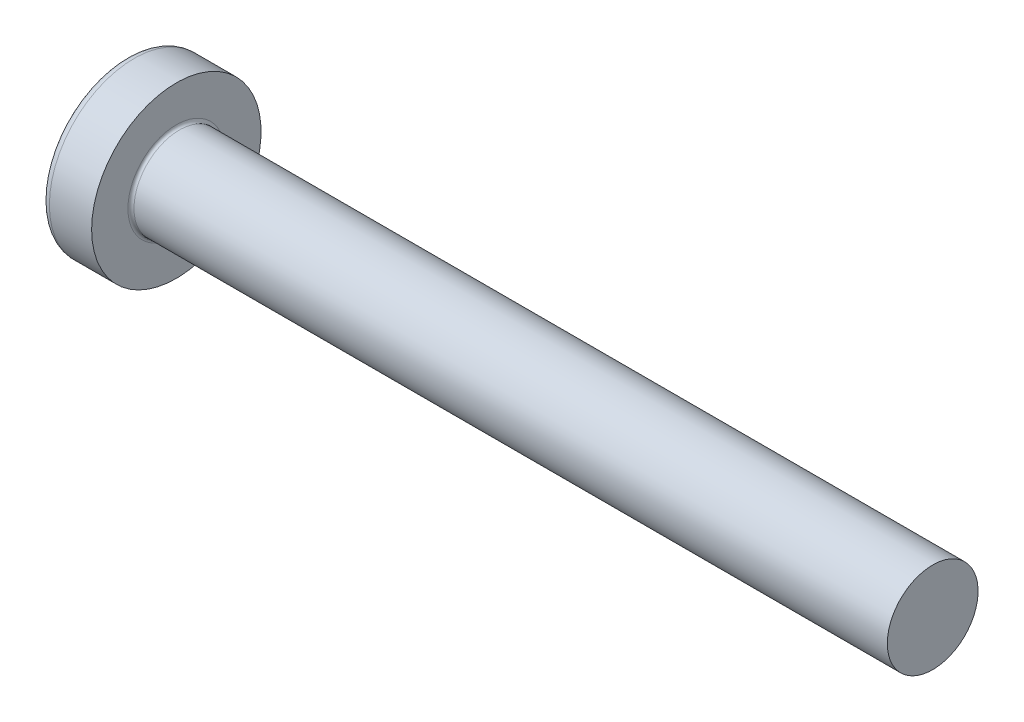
ISO-10303-21;
HEADER;
FILE_DESCRIPTION(('STEP AP214'),'2;1');
FILE_NAME('part.step','',(''),(''),'','','');
FILE_SCHEMA(('AUTOMOTIVE_DESIGN { 1 0 10303 214 1 1 1 1 }'));
ENDSEC;
DATA;
#1=APPLICATION_CONTEXT('core data for automotive mechanical design processes');
#2=APPLICATION_PROTOCOL_DEFINITION('international standard','automotive_design',2000,#1);
#3=PRODUCT_CONTEXT('',#1,'mechanical');
#4=PRODUCT('Part','Part','',(#3));
#5=PRODUCT_RELATED_PRODUCT_CATEGORY('part','',(#4));
#6=PRODUCT_DEFINITION_FORMATION('','',#4);
#7=PRODUCT_DEFINITION_CONTEXT('part definition',#1,'design');
#8=PRODUCT_DEFINITION('design','',#6,#7);
#9=PRODUCT_DEFINITION_SHAPE('','',#8);
#10=(LENGTH_UNIT() NAMED_UNIT(*) SI_UNIT(.MILLI.,.METRE.));
#11=(NAMED_UNIT(*) PLANE_ANGLE_UNIT() SI_UNIT($,.RADIAN.));
#12=(NAMED_UNIT(*) SI_UNIT($,.STERADIAN.) SOLID_ANGLE_UNIT());
#13=UNCERTAINTY_MEASURE_WITH_UNIT(LENGTH_MEASURE(1.E-05),#10,'distance_accuracy_value','');
#14=(GEOMETRIC_REPRESENTATION_CONTEXT(3) GLOBAL_UNCERTAINTY_ASSIGNED_CONTEXT((#13)) GLOBAL_UNIT_ASSIGNED_CONTEXT((#10,
#11,#12)) REPRESENTATION_CONTEXT('',''));
#15=CARTESIAN_POINT('',(0.,0.,0.));
#16=DIRECTION('',(0.,0.,1.));
#17=DIRECTION('',(1.,0.,0.));
#18=AXIS2_PLACEMENT_3D('',#15,#16,#17);
#19=CARTESIAN_POINT('',(5.,0.,0.));
#20=DIRECTION('',(-1.,0.,0.));
#21=DIRECTION('',(0.,1.,0.));
#22=AXIS2_PLACEMENT_3D('',#19,#20,#21);
#23=SPHERICAL_SURFACE('',#22,5.);
#24=CARTESIAN_POINT('',(0.775371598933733,0.,0.));
#25=DIRECTION('',(-1.,0.,0.));
#26=DIRECTION('',(0.,0.,1.));
#27=AXIS2_PLACEMENT_3D('',#24,#25,#26);
#28=CIRCLE('',#27,2.67441860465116);
#29=CARTESIAN_POINT('',(0.775371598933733,0.,2.67441860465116));
#30=VERTEX_POINT('',#29);
#31=EDGE_CURVE('E239',#30,#30,#28,.T.);
#32=ORIENTED_EDGE('',*,*,#31,.T.);
#33=EDGE_LOOP('',(#32));
#34=FACE_BOUND('',#33,.T.);
#35=CARTESIAN_POINT('',(0.0457951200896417,0.,0.));
#36=DIRECTION('',(1.,0.,0.));
#37=DIRECTION('',(0.,0.,-1.));
#38=AXIS2_PLACEMENT_3D('',#35,#36,#37);
#39=CIRCLE('',#38,0.675169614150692);
#40=CARTESIAN_POINT('',(0.0457951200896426,-0.369999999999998,-0.564760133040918));
#41=VERTEX_POINT('',#40);
#42=CARTESIAN_POINT('',(0.0457951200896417,-0.564760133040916,-0.37));
#43=VERTEX_POINT('',#42);
#44=EDGE_CURVE('E455',#41,#43,#39,.F.);
#45=ORIENTED_EDGE('',*,*,#44,.F.);
#46=CARTESIAN_POINT('',(5.,-0.37,0.));
#47=DIRECTION('',(0.,1.,0.));
#48=DIRECTION('',(0.,0.,1.));
#49=AXIS2_PLACEMENT_3D('',#46,#47,#48);
#50=CIRCLE('',#49,4.98629120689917);
#51=CARTESIAN_POINT('',(0.187869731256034,-0.369999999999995,-1.30633161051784));
#52=VERTEX_POINT('',#51);
#53=EDGE_CURVE('E286',#52,#41,#50,.T.);
#54=ORIENTED_EDGE('',*,*,#53,.F.);
#55=CARTESIAN_POINT('',(4.56358245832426,0.,0.875318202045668));
#56=DIRECTION('',(0.446197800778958,0.,-0.894934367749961));
#57=DIRECTION('',(-0.89493436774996,0.,-0.446197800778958));
#58=AXIS2_PLACEMENT_3D('',#55,#56,#57);
#59=CIRCLE('',#58,4.90340267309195);
#60=CARTESIAN_POINT('',(0.187869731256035,0.370000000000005,-1.30633161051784));
#61=VERTEX_POINT('',#60);
#62=EDGE_CURVE('E258',#52,#61,#59,.T.);
#63=ORIENTED_EDGE('',*,*,#62,.T.);
#64=CARTESIAN_POINT('',(5.,0.37,0.));
#65=DIRECTION('',(0.,-1.,0.));
#66=DIRECTION('',(0.,0.,-1.));
#67=AXIS2_PLACEMENT_3D('',#64,#65,#66);
#68=CIRCLE('',#67,4.98629120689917);
#69=CARTESIAN_POINT('',(0.0457951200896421,0.370000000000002,-0.564760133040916));
#70=VERTEX_POINT('',#69);
#71=EDGE_CURVE('E294',#70,#61,#68,.T.);
#72=ORIENTED_EDGE('',*,*,#71,.F.);
#73=CARTESIAN_POINT('',(0.0457951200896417,0.564760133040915,-0.37));
#74=VERTEX_POINT('',#73);
#75=EDGE_CURVE('E368',#74,#70,#39,.F.);
#76=ORIENTED_EDGE('',*,*,#75,.F.);
#77=CARTESIAN_POINT('',(5.,0.,-0.37));
#78=DIRECTION('',(0.,0.,1.));
#79=DIRECTION('',(1.,0.,0.));
#80=AXIS2_PLACEMENT_3D('',#77,#78,#79);
#81=CIRCLE('',#80,4.98629120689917);
#82=CARTESIAN_POINT('',(0.187869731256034,1.30633161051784,-0.37));
#83=VERTEX_POINT('',#82);
#84=EDGE_CURVE('E252',#83,#74,#81,.T.);
#85=ORIENTED_EDGE('',*,*,#84,.F.);
#86=CARTESIAN_POINT('',(4.56358245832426,-0.875318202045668,0.));
#87=DIRECTION('',(0.446197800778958,0.894934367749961,0.));
#88=DIRECTION('',(-0.89493436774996,0.446197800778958,0.));
#89=AXIS2_PLACEMENT_3D('',#86,#87,#88);
#90=CIRCLE('',#89,4.90340267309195);
#91=CARTESIAN_POINT('',(0.187869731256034,1.30633161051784,0.37));
#92=VERTEX_POINT('',#91);
#93=EDGE_CURVE('E255',#83,#92,#90,.T.);
#94=ORIENTED_EDGE('',*,*,#93,.T.);
#95=CARTESIAN_POINT('',(5.,0.,0.37));
#96=DIRECTION('',(0.,0.,-1.));
#97=DIRECTION('',(0.,1.,0.));
#98=AXIS2_PLACEMENT_3D('',#95,#96,#97);
#99=CIRCLE('',#98,4.98629120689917);
#100=CARTESIAN_POINT('',(0.0457951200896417,0.564760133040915,0.37));
#101=VERTEX_POINT('',#100);
#102=EDGE_CURVE('E248',#101,#92,#99,.T.);
#103=ORIENTED_EDGE('',*,*,#102,.F.);
#104=CARTESIAN_POINT('',(0.0457951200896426,0.369999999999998,0.564760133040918));
#105=VERTEX_POINT('',#104);
#106=EDGE_CURVE('E401',#105,#101,#39,.F.);
#107=ORIENTED_EDGE('',*,*,#106,.F.);
#108=CARTESIAN_POINT('',(0.187869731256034,0.369999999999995,1.30633161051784));
#109=VERTEX_POINT('',#108);
#110=EDGE_CURVE('E268',#109,#105,#68,.T.);
#111=ORIENTED_EDGE('',*,*,#110,.F.);
#112=CARTESIAN_POINT('',(4.56358245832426,0.,-0.875318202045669));
#113=DIRECTION('',(0.446197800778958,0.,0.894934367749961));
#114=DIRECTION('',(0.89493436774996,0.,-0.446197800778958));
#115=AXIS2_PLACEMENT_3D('',#112,#113,#114);
#116=CIRCLE('',#115,4.90340267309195);
#117=CARTESIAN_POINT('',(0.187869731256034,-0.370000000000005,1.30633161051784));
#118=VERTEX_POINT('',#117);
#119=EDGE_CURVE('E52',#109,#118,#116,.T.);
#120=ORIENTED_EDGE('',*,*,#119,.T.);
#121=CARTESIAN_POINT('',(0.0457951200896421,-0.370000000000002,0.564760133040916));
#122=VERTEX_POINT('',#121);
#123=EDGE_CURVE('E265',#122,#118,#50,.T.);
#124=ORIENTED_EDGE('',*,*,#123,.F.);
#125=CARTESIAN_POINT('',(0.0457951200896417,-0.564760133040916,0.37));
#126=VERTEX_POINT('',#125);
#127=EDGE_CURVE('E440',#126,#122,#39,.F.);
#128=ORIENTED_EDGE('',*,*,#127,.F.);
#129=CARTESIAN_POINT('',(0.187869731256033,-1.30633161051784,0.37));
#130=VERTEX_POINT('',#129);
#131=EDGE_CURVE('E249',#130,#126,#99,.T.);
#132=ORIENTED_EDGE('',*,*,#131,.F.);
#133=CARTESIAN_POINT('',(4.56358245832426,0.875318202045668,0.));
#134=DIRECTION('',(0.446197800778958,-0.894934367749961,0.));
#135=DIRECTION('',(0.89493436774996,0.446197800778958,0.));
#136=AXIS2_PLACEMENT_3D('',#133,#134,#135);
#137=CIRCLE('',#136,4.90340267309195);
#138=CARTESIAN_POINT('',(0.187869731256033,-1.30633161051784,-0.37));
#139=VERTEX_POINT('',#138);
#140=EDGE_CURVE('E245',#130,#139,#137,.T.);
#141=ORIENTED_EDGE('',*,*,#140,.T.);
#142=EDGE_CURVE('E67',#43,#139,#81,.T.);
#143=ORIENTED_EDGE('',*,*,#142,.F.);
#144=EDGE_LOOP('',(#45,#54,#63,#72,#76,#85,#94,#103,#107,#111,#120,#124,#128,#132,#141,#143));
#145=FACE_BOUND('',#144,.T.);
#146=ADVANCED_FACE('F39',(#34,#145),#23,.T.);
#147=CARTESIAN_POINT('',(1.75,0.527482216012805,-0.37));
#148=DIRECTION('',(0.,0.,1.));
#149=DIRECTION('',(1.,0.,0.));
#150=AXIS2_PLACEMENT_3D('',#147,#148,#149);
#151=PLANE('',#150);
#152=ORIENTED_EDGE('',*,*,#84,.T.);
#153=CARTESIAN_POINT('',(-0.987293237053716,0.649401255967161,-0.37));
#154=CARTESIAN_POINT('',(-0.781914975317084,0.632865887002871,-0.37));
#155=CARTESIAN_POINT('',(-0.576547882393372,0.616188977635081,-0.37));
#156=CARTESIAN_POINT('',(-0.165841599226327,0.582441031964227,-0.37));
#157=CARTESIAN_POINT('',(0.0394975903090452,0.56536998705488,-0.37));
#158=CARTESIAN_POINT('',(0.450133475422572,0.530723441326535,-0.37));
#159=CARTESIAN_POINT('',(0.655430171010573,0.513147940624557,-0.37));
#160=CARTESIAN_POINT('',(1.06596140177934,0.477314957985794,-0.37));
#161=CARTESIAN_POINT('',(1.2711959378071,0.459057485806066,-0.37));
#162=CARTESIAN_POINT('',(1.61065292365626,0.428051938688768,-0.37));
#163=CARTESIAN_POINT('',(1.74490059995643,0.415580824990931,-0.37));
#164=CARTESIAN_POINT('',(2.01334321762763,0.390092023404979,-0.37));
#165=CARTESIAN_POINT('',(2.14753815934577,0.377074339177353,-0.37));
#166=CARTESIAN_POINT('',(2.41586354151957,0.350315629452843,-0.37));
#167=CARTESIAN_POINT('',(2.5499939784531,0.33657456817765,-0.37));
#168=CARTESIAN_POINT('',(2.81814173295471,0.308004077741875,-0.37));
#169=CARTESIAN_POINT('',(2.95215904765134,0.293174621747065,-0.37));
#170=CARTESIAN_POINT('',(3.0860955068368,0.277618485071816,-0.37));
#171=B_SPLINE_CURVE_WITH_KNOTS('',3,(#153,#154,#155,#156,#157,#158,#159,#160,#161,#162,#163,
#164,#165,#166,#167,#168,#169,#170),.UNSPECIFIED.,.F.,.F.,(4,2,2,2,2,2,2,2,4),(0.,
0.618128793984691,1.23627109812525,1.85441325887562,2.4725465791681,2.87702276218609,
3.28149623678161,3.68598973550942,4.09049321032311),.UNSPECIFIED.);
#172=CARTESIAN_POINT('',(1.75,0.415013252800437,-0.37));
#173=VERTEX_POINT('',#172);
#174=EDGE_CURVE('E361',#74,#173,#171,.T.);
#175=ORIENTED_EDGE('',*,*,#174,.T.);
#176=DIRECTION('',(0.,1.,0.));
#177=VECTOR('',#176,1.);
#178=CARTESIAN_POINT('',(1.75,-0.527482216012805,-0.37));
#179=LINE('',#178,#177);
#180=CARTESIAN_POINT('',(1.75,0.527482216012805,-0.37));
#181=VERTEX_POINT('',#180);
#182=EDGE_CURVE('E311',#173,#181,#179,.T.);
#183=ORIENTED_EDGE('',*,*,#182,.T.);
#184=DIRECTION('',(0.89493436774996,-0.446197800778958,0.));
#185=VECTOR('',#184,1.);
#186=CARTESIAN_POINT('',(0.,1.4,-0.37));
#187=LINE('',#186,#185);
#188=EDGE_CURVE('E317',#83,#181,#187,.T.);
#189=ORIENTED_EDGE('',*,*,#188,.F.);
#190=EDGE_LOOP('',(#152,#175,#183,#189));
#191=FACE_BOUND('',#190,.T.);
#192=ADVANCED_FACE('F197',(#191),#151,.T.);
#193=CARTESIAN_POINT('',(1.75,-0.527482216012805,-0.37));
#194=VERTEX_POINT('',#193);
#195=CARTESIAN_POINT('',(1.75,-0.415013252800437,-0.37));
#196=VERTEX_POINT('',#195);
#197=EDGE_CURVE('E308',#194,#196,#179,.T.);
#198=ORIENTED_EDGE('',*,*,#197,.T.);
#199=CARTESIAN_POINT('',(-0.987293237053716,-0.649401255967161,-0.37));
#200=CARTESIAN_POINT('',(-0.781914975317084,-0.632865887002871,-0.37));
#201=CARTESIAN_POINT('',(-0.576547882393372,-0.616188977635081,-0.37));
#202=CARTESIAN_POINT('',(-0.165841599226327,-0.582441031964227,-0.37));
#203=CARTESIAN_POINT('',(0.0394975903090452,-0.56536998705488,-0.37));
#204=CARTESIAN_POINT('',(0.450133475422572,-0.530723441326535,-0.37));
#205=CARTESIAN_POINT('',(0.655430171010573,-0.513147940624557,-0.37));
#206=CARTESIAN_POINT('',(1.06596140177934,-0.477314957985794,-0.37));
#207=CARTESIAN_POINT('',(1.2711959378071,-0.459057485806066,-0.37));
#208=CARTESIAN_POINT('',(1.61065292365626,-0.428051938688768,-0.37));
#209=CARTESIAN_POINT('',(1.74490059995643,-0.415580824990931,-0.37));
#210=CARTESIAN_POINT('',(2.01334321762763,-0.390092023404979,-0.37));
#211=CARTESIAN_POINT('',(2.14753815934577,-0.377074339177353,-0.37));
#212=CARTESIAN_POINT('',(2.41586354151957,-0.350315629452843,-0.37));
#213=CARTESIAN_POINT('',(2.5499939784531,-0.33657456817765,-0.37));
#214=CARTESIAN_POINT('',(2.81814173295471,-0.308004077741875,-0.37));
#215=CARTESIAN_POINT('',(2.95215904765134,-0.293174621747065,-0.37));
#216=CARTESIAN_POINT('',(3.0860955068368,-0.277618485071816,-0.37));
#217=B_SPLINE_CURVE_WITH_KNOTS('',3,(#199,#200,#201,#202,#203,#204,#205,#206,#207,#208,#209,
#210,#211,#212,#213,#214,#215,#216),.UNSPECIFIED.,.F.,.F.,(4,2,2,2,2,2,2,2,4),(0.,
0.618128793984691,1.23627109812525,1.85441325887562,2.4725465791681,2.87702276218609,
3.28149623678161,3.68598973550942,4.09049321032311),.UNSPECIFIED.);
#218=EDGE_CURVE('E354',#196,#43,#217,.F.);
#219=ORIENTED_EDGE('',*,*,#218,.T.);
#220=ORIENTED_EDGE('',*,*,#142,.T.);
#221=DIRECTION('',(0.89493436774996,0.446197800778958,0.));
#222=VECTOR('',#221,1.);
#223=CARTESIAN_POINT('',(0.,-1.4,-0.37));
#224=LINE('',#223,#222);
#225=EDGE_CURVE('E314',#139,#194,#224,.T.);
#226=ORIENTED_EDGE('',*,*,#225,.T.);
#227=EDGE_LOOP('',(#198,#219,#220,#226));
#228=FACE_BOUND('',#227,.T.);
#229=ADVANCED_FACE('F203',(#228),#151,.T.);
#230=CARTESIAN_POINT('',(1.75,-0.527482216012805,0.37));
#231=DIRECTION('',(0.,0.,-1.));
#232=DIRECTION('',(0.,1.,0.));
#233=AXIS2_PLACEMENT_3D('',#230,#231,#232);
#234=PLANE('',#233);
#235=DIRECTION('',(0.,-1.,0.));
#236=VECTOR('',#235,1.);
#237=CARTESIAN_POINT('',(1.75,0.527482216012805,0.37));
#238=LINE('',#237,#236);
#239=CARTESIAN_POINT('',(1.75,0.527482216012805,0.37));
#240=VERTEX_POINT('',#239);
#241=CARTESIAN_POINT('',(1.75,0.415013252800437,0.37));
#242=VERTEX_POINT('',#241);
#243=EDGE_CURVE('E300',#240,#242,#238,.T.);
#244=ORIENTED_EDGE('',*,*,#243,.T.);
#245=CARTESIAN_POINT('',(-0.987293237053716,0.649401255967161,0.37));
#246=CARTESIAN_POINT('',(-0.781914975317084,0.632865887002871,0.37));
#247=CARTESIAN_POINT('',(-0.576547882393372,0.616188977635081,0.37));
#248=CARTESIAN_POINT('',(-0.165841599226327,0.582441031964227,0.37));
#249=CARTESIAN_POINT('',(0.0394975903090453,0.56536998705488,0.37));
#250=CARTESIAN_POINT('',(0.450133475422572,0.530723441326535,0.37));
#251=CARTESIAN_POINT('',(0.655430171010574,0.513147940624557,0.37));
#252=CARTESIAN_POINT('',(1.06596140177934,0.477314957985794,0.37));
#253=CARTESIAN_POINT('',(1.2711959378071,0.459057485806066,0.37));
#254=CARTESIAN_POINT('',(1.61065292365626,0.428051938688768,0.37));
#255=CARTESIAN_POINT('',(1.74490059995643,0.415580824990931,0.37));
#256=CARTESIAN_POINT('',(2.01334321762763,0.39009202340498,0.37));
#257=CARTESIAN_POINT('',(2.14753815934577,0.377074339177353,0.37));
#258=CARTESIAN_POINT('',(2.41586354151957,0.350315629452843,0.37));
#259=CARTESIAN_POINT('',(2.5499939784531,0.33657456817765,0.37));
#260=CARTESIAN_POINT('',(2.81814173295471,0.308004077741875,0.37));
#261=CARTESIAN_POINT('',(2.95215904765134,0.293174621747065,0.37));
#262=CARTESIAN_POINT('',(3.0860955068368,0.277618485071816,0.37));
#263=B_SPLINE_CURVE_WITH_KNOTS('',3,(#245,#246,#247,#248,#249,#250,#251,#252,#253,#254,#255,
#256,#257,#258,#259,#260,#261,#262),.UNSPECIFIED.,.F.,.F.,(4,2,2,2,2,2,2,2,4),(0.,
0.618128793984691,1.23627109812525,1.85441325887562,2.4725465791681,2.87702276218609,
3.28149623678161,3.68598973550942,4.09049321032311),.UNSPECIFIED.);
#264=EDGE_CURVE('E402',#242,#101,#263,.F.);
#265=ORIENTED_EDGE('',*,*,#264,.T.);
#266=ORIENTED_EDGE('',*,*,#102,.T.);
#267=DIRECTION('',(0.89493436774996,-0.446197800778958,0.));
#268=VECTOR('',#267,1.);
#269=CARTESIAN_POINT('',(0.,1.4,0.37));
#270=LINE('',#269,#268);
#271=EDGE_CURVE('E316',#92,#240,#270,.T.);
#272=ORIENTED_EDGE('',*,*,#271,.T.);
#273=EDGE_LOOP('',(#244,#265,#266,#272));
#274=FACE_BOUND('',#273,.T.);
#275=ADVANCED_FACE('F349',(#274),#234,.T.);
#276=ORIENTED_EDGE('',*,*,#131,.T.);
#277=CARTESIAN_POINT('',(-0.987293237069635,-0.649401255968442,0.37));
#278=CARTESIAN_POINT('',(-0.781914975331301,-0.632865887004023,0.37));
#279=CARTESIAN_POINT('',(-0.576547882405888,-0.616188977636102,0.37));
#280=CARTESIAN_POINT('',(-0.16584159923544,-0.582441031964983,0.37));
#281=CARTESIAN_POINT('',(0.0394975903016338,-0.5653699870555,0.37));
#282=CARTESIAN_POINT('',(0.450133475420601,-0.530723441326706,0.37));
#283=CARTESIAN_POINT('',(0.655430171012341,-0.513147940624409,0.37));
#284=CARTESIAN_POINT('',(1.06596140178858,-0.477314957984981,0.37));
#285=CARTESIAN_POINT('',(1.27119593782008,-0.459057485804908,0.37));
#286=CARTESIAN_POINT('',(1.61065292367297,-0.428051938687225,0.37));
#287=CARTESIAN_POINT('',(1.74490059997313,-0.415580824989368,0.37));
#288=CARTESIAN_POINT('',(2.01334321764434,-0.390092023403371,0.37));
#289=CARTESIAN_POINT('',(2.14753815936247,-0.377074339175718,0.37));
#290=CARTESIAN_POINT('',(2.41586354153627,-0.350315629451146,0.37));
#291=CARTESIAN_POINT('',(2.54999397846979,-0.336574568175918,0.37));
#292=CARTESIAN_POINT('',(2.8181417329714,-0.308004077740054,0.37));
#293=CARTESIAN_POINT('',(2.95215904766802,-0.29317462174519,0.37));
#294=CARTESIAN_POINT('',(3.08609550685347,-0.277618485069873,0.37));
#295=B_SPLINE_CURVE_WITH_KNOTS('',3,(#277,#278,#279,#280,#281,#282,#283,#284,#285,#286,#287,
#288,#289,#290,#291,#292,#293,#294),.UNSPECIFIED.,.F.,.F.,(4,2,2,2,2,2,2,2,4),(0.,
0.61812879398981,1.23627109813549,1.85441325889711,2.47254657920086,2.87702276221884,
3.28149623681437,3.68598973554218,4.09049321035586),.UNSPECIFIED.);
#296=CARTESIAN_POINT('',(1.75,-0.415013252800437,0.37));
#297=VERTEX_POINT('',#296);
#298=EDGE_CURVE('E392',#126,#297,#295,.T.);
#299=ORIENTED_EDGE('',*,*,#298,.T.);
#300=CARTESIAN_POINT('',(1.75,-0.527482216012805,0.37));
#301=VERTEX_POINT('',#300);
#302=EDGE_CURVE('E303',#297,#301,#238,.T.);
#303=ORIENTED_EDGE('',*,*,#302,.T.);
#304=DIRECTION('',(0.89493436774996,0.446197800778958,0.));
#305=VECTOR('',#304,1.);
#306=CARTESIAN_POINT('',(0.,-1.4,0.37));
#307=LINE('',#306,#305);
#308=EDGE_CURVE('E298',#130,#301,#307,.T.);
#309=ORIENTED_EDGE('',*,*,#308,.F.);
#310=EDGE_LOOP('',(#276,#299,#303,#309));
#311=FACE_BOUND('',#310,.T.);
#312=ADVANCED_FACE('F345',(#311),#234,.T.);
#313=CARTESIAN_POINT('',(1.75,0.527482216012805,0.37));
#314=DIRECTION('',(0.446197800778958,0.894934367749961,0.));
#315=DIRECTION('',(-0.89493436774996,0.446197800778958,0.));
#316=AXIS2_PLACEMENT_3D('',#313,#314,#315);
#317=PLANE('',#316);
#318=CARTESIAN_POINT('',(2.66965234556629,0.0689604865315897,0.));
#319=DIRECTION('',(0.446197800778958,0.894934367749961,0.));
#320=DIRECTION('',(-0.89493436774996,0.446197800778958,0.));
#321=AXIS2_PLACEMENT_3D('',#318,#319,#320);
#322=ELLIPSE('',#321,1.10195891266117,0.486831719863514);
#323=CARTESIAN_POINT('',(1.75,0.527482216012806,0.175779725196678));
#324=VERTEX_POINT('',#323);
#325=CARTESIAN_POINT('',(1.75,0.527482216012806,-0.175779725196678));
#326=VERTEX_POINT('',#325);
#327=EDGE_CURVE('E432',#324,#326,#322,.F.);
#328=ORIENTED_EDGE('',*,*,#327,.F.);
#329=DIRECTION('',(0.,0.,-1.));
#330=VECTOR('',#329,1.);
#331=CARTESIAN_POINT('',(1.75,0.527482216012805,0.37));
#332=LINE('',#331,#330);
#333=EDGE_CURVE('E304',#240,#324,#332,.T.);
#334=ORIENTED_EDGE('',*,*,#333,.F.);
#335=ORIENTED_EDGE('',*,*,#271,.F.);
#336=ORIENTED_EDGE('',*,*,#93,.F.);
#337=ORIENTED_EDGE('',*,*,#188,.T.);
#338=EDGE_CURVE('E307',#326,#181,#332,.T.);
#339=ORIENTED_EDGE('',*,*,#338,.F.);
#340=EDGE_LOOP('',(#328,#334,#335,#336,#337,#339));
#341=FACE_BOUND('',#340,.T.);
#342=ADVANCED_FACE('F342',(#341),#317,.F.);
#343=CARTESIAN_POINT('',(0.,-1.4,-0.37));
#344=DIRECTION('',(0.446197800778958,-0.894934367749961,0.));
#345=DIRECTION('',(0.89493436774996,0.446197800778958,0.));
#346=AXIS2_PLACEMENT_3D('',#343,#344,#345);
#347=PLANE('',#346);
#348=CARTESIAN_POINT('',(2.66965234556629,-0.0689604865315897,0.));
#349=DIRECTION('',(0.446197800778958,-0.894934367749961,0.));
#350=DIRECTION('',(-0.89493436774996,-0.446197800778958,0.));
#351=AXIS2_PLACEMENT_3D('',#348,#349,#350);
#352=ELLIPSE('',#351,1.10195891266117,0.486831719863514);
#353=CARTESIAN_POINT('',(1.75,-0.527482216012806,-0.175779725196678));
#354=VERTEX_POINT('',#353);
#355=CARTESIAN_POINT('',(1.75,-0.527482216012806,0.175779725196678));
#356=VERTEX_POINT('',#355);
#357=EDGE_CURVE('E428',#354,#356,#352,.F.);
#358=ORIENTED_EDGE('',*,*,#357,.F.);
#359=DIRECTION('',(0.,0.,1.));
#360=VECTOR('',#359,1.);
#361=CARTESIAN_POINT('',(1.75,-0.527482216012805,-0.37));
#362=LINE('',#361,#360);
#363=EDGE_CURVE('E295',#194,#354,#362,.T.);
#364=ORIENTED_EDGE('',*,*,#363,.F.);
#365=ORIENTED_EDGE('',*,*,#225,.F.);
#366=ORIENTED_EDGE('',*,*,#140,.F.);
#367=ORIENTED_EDGE('',*,*,#308,.T.);
#368=EDGE_CURVE('E299',#356,#301,#362,.T.);
#369=ORIENTED_EDGE('',*,*,#368,.F.);
#370=EDGE_LOOP('',(#358,#364,#365,#366,#367,#369));
#371=FACE_BOUND('',#370,.T.);
#372=ADVANCED_FACE('F344',(#371),#347,.F.);
#373=CARTESIAN_POINT('',(1.75,0.527482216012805,-0.37));
#374=DIRECTION('',(-1.,0.,0.));
#375=DIRECTION('',(0.,0.,1.));
#376=AXIS2_PLACEMENT_3D('',#373,#374,#375);
#377=PLANE('',#376);
#378=DIRECTION('',(0.,1.,0.));
#379=VECTOR('',#378,1.);
#380=CARTESIAN_POINT('',(1.75,-0.370000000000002,0.527482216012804));
#381=LINE('',#380,#379);
#382=CARTESIAN_POINT('',(1.75,-0.370000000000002,0.527482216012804));
#383=VERTEX_POINT('',#382);
#384=CARTESIAN_POINT('',(1.75,-0.175779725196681,0.527482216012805));
#385=VERTEX_POINT('',#384);
#386=EDGE_CURVE('E496',#383,#385,#381,.T.);
#387=ORIENTED_EDGE('',*,*,#386,.T.);
#388=CARTESIAN_POINT('',(1.75,0.,0.));
#389=DIRECTION('',(-1.,0.,0.));
#390=DIRECTION('',(0.,0.,1.));
#391=AXIS2_PLACEMENT_3D('',#388,#389,#390);
#392=CIRCLE('',#391,0.556);
#393=CARTESIAN_POINT('',(1.75,-0.370000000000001,0.415013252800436));
#394=VERTEX_POINT('',#393);
#395=EDGE_CURVE('E453',#394,#385,#392,.T.);
#396=ORIENTED_EDGE('',*,*,#395,.F.);
#397=DIRECTION('',(0.,0.,-1.));
#398=VECTOR('',#397,1.);
#399=CARTESIAN_POINT('',(1.75,-0.370000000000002,0.527482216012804));
#400=LINE('',#399,#398);
#401=EDGE_CURVE('E491',#383,#394,#400,.T.);
#402=ORIENTED_EDGE('',*,*,#401,.F.);
#403=EDGE_LOOP('',(#387,#396,#402));
#404=FACE_BOUND('',#403,.T.);
#405=ADVANCED_FACE('F417',(#404),#377,.T.);
#406=ORIENTED_EDGE('',*,*,#302,.F.);
#407=EDGE_CURVE('E448',#356,#297,#392,.T.);
#408=ORIENTED_EDGE('',*,*,#407,.F.);
#409=ORIENTED_EDGE('',*,*,#368,.T.);
#410=EDGE_LOOP('',(#406,#408,#409));
#411=FACE_BOUND('',#410,.T.);
#412=ADVANCED_FACE('F419',(#411),#377,.T.);
#413=ORIENTED_EDGE('',*,*,#363,.T.);
#414=EDGE_CURVE('E437',#196,#354,#392,.T.);
#415=ORIENTED_EDGE('',*,*,#414,.F.);
#416=ORIENTED_EDGE('',*,*,#197,.F.);
#417=EDGE_LOOP('',(#413,#415,#416));
#418=FACE_BOUND('',#417,.T.);
#419=ADVANCED_FACE('F435',(#418),#377,.T.);
#420=CARTESIAN_POINT('',(1.75,-0.369999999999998,-0.415013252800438));
#421=VERTEX_POINT('',#420);
#422=CARTESIAN_POINT('',(1.75,-0.369999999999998,-0.527482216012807));
#423=VERTEX_POINT('',#422);
#424=EDGE_CURVE('E485',#421,#423,#400,.T.);
#425=ORIENTED_EDGE('',*,*,#424,.F.);
#426=CARTESIAN_POINT('',(1.75,-0.175779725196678,-0.527482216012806));
#427=VERTEX_POINT('',#426);
#428=EDGE_CURVE('E59',#427,#421,#392,.T.);
#429=ORIENTED_EDGE('',*,*,#428,.F.);
#430=DIRECTION('',(0.,-1.,0.));
#431=VECTOR('',#430,1.);
#432=CARTESIAN_POINT('',(1.75,0.370000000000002,-0.527482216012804));
#433=LINE('',#432,#431);
#434=EDGE_CURVE('E483',#427,#423,#433,.T.);
#435=ORIENTED_EDGE('',*,*,#434,.T.);
#436=EDGE_LOOP('',(#425,#429,#435));
#437=FACE_BOUND('',#436,.T.);
#438=ADVANCED_FACE('F482',(#437),#377,.T.);
#439=CARTESIAN_POINT('',(1.75,0.370000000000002,-0.527482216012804));
#440=VERTEX_POINT('',#439);
#441=CARTESIAN_POINT('',(1.75,0.175779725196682,-0.527482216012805));
#442=VERTEX_POINT('',#441);
#443=EDGE_CURVE('E490',#440,#442,#433,.T.);
#444=ORIENTED_EDGE('',*,*,#443,.T.);
#445=CARTESIAN_POINT('',(1.75,0.370000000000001,-0.415013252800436));
#446=VERTEX_POINT('',#445);
#447=EDGE_CURVE('E479',#446,#442,#392,.T.);
#448=ORIENTED_EDGE('',*,*,#447,.F.);
#449=DIRECTION('',(0.,0.,1.));
#450=VECTOR('',#449,1.);
#451=CARTESIAN_POINT('',(1.75,0.370000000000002,-0.527482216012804));
#452=LINE('',#451,#450);
#453=EDGE_CURVE('E500',#440,#446,#452,.T.);
#454=ORIENTED_EDGE('',*,*,#453,.F.);
#455=EDGE_LOOP('',(#444,#448,#454));
#456=FACE_BOUND('',#455,.T.);
#457=ADVANCED_FACE('F507',(#456),#377,.T.);
#458=ORIENTED_EDGE('',*,*,#182,.F.);
#459=EDGE_CURVE('E509',#326,#173,#392,.T.);
#460=ORIENTED_EDGE('',*,*,#459,.F.);
#461=ORIENTED_EDGE('',*,*,#338,.T.);
#462=EDGE_LOOP('',(#458,#460,#461));
#463=FACE_BOUND('',#462,.T.);
#464=ADVANCED_FACE('F535',(#463),#377,.T.);
#465=ORIENTED_EDGE('',*,*,#333,.T.);
#466=EDGE_CURVE('E514',#242,#324,#392,.T.);
#467=ORIENTED_EDGE('',*,*,#466,.F.);
#468=ORIENTED_EDGE('',*,*,#243,.F.);
#469=EDGE_LOOP('',(#465,#467,#468));
#470=FACE_BOUND('',#469,.T.);
#471=ADVANCED_FACE('F523',(#470),#377,.T.);
#472=CARTESIAN_POINT('',(1.75,0.369999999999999,0.415013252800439));
#473=VERTEX_POINT('',#472);
#474=CARTESIAN_POINT('',(1.75,0.369999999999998,0.527482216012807));
#475=VERTEX_POINT('',#474);
#476=EDGE_CURVE('E283',#473,#475,#452,.T.);
#477=ORIENTED_EDGE('',*,*,#476,.F.);
#478=CARTESIAN_POINT('',(1.75,0.175779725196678,0.527482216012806));
#479=VERTEX_POINT('',#478);
#480=EDGE_CURVE('E454',#479,#473,#392,.T.);
#481=ORIENTED_EDGE('',*,*,#480,.F.);
#482=EDGE_CURVE('E499',#479,#475,#381,.T.);
#483=ORIENTED_EDGE('',*,*,#482,.T.);
#484=EDGE_LOOP('',(#477,#481,#483));
#485=FACE_BOUND('',#484,.T.);
#486=ADVANCED_FACE('F411',(#485),#377,.T.);
#487=CARTESIAN_POINT('',(1.75,0.369999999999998,0.527482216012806));
#488=DIRECTION('',(0.,-1.,0.));
#489=DIRECTION('',(1.,0.,0.));
#490=AXIS2_PLACEMENT_3D('',#487,#488,#489);
#491=PLANE('',#490);
#492=ORIENTED_EDGE('',*,*,#110,.T.);
#493=CARTESIAN_POINT('',(-0.987293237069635,0.369999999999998,0.649401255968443));
#494=CARTESIAN_POINT('',(-0.781914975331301,0.369999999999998,0.632865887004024));
#495=CARTESIAN_POINT('',(-0.576547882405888,0.369999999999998,0.616188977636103));
#496=CARTESIAN_POINT('',(-0.16584159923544,0.369999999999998,0.582441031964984));
#497=CARTESIAN_POINT('',(0.0394975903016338,0.369999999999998,0.565369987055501));
#498=CARTESIAN_POINT('',(0.450133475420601,0.369999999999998,0.530723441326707));
#499=CARTESIAN_POINT('',(0.655430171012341,0.369999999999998,0.51314794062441));
#500=CARTESIAN_POINT('',(1.06596140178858,0.369999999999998,0.477314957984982));
#501=CARTESIAN_POINT('',(1.27119593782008,0.369999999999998,0.459057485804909));
#502=CARTESIAN_POINT('',(1.61065292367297,0.369999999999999,0.428051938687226));
#503=CARTESIAN_POINT('',(1.74490059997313,0.369999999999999,0.415580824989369));
#504=CARTESIAN_POINT('',(2.01334321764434,0.369999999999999,0.390092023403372));
#505=CARTESIAN_POINT('',(2.14753815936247,0.369999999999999,0.37707433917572));
#506=CARTESIAN_POINT('',(2.41586354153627,0.369999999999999,0.350315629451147));
#507=CARTESIAN_POINT('',(2.54999397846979,0.369999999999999,0.336574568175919));
#508=CARTESIAN_POINT('',(2.8181417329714,0.369999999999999,0.308004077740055));
#509=CARTESIAN_POINT('',(2.95215904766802,0.369999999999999,0.293174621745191));
#510=CARTESIAN_POINT('',(3.08609550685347,0.369999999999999,0.277618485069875));
#511=B_SPLINE_CURVE_WITH_KNOTS('',3,(#493,#494,#495,#496,#497,#498,#499,#500,#501,#502,#503,
#504,#505,#506,#507,#508,#509,#510),.UNSPECIFIED.,.F.,.F.,(4,2,2,2,2,2,2,2,4),(0.,
0.61812879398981,1.23627109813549,1.85441325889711,2.47254657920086,2.87702276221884,
3.28149623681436,3.68598973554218,4.09049321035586),.UNSPECIFIED.);
#512=EDGE_CURVE('E397',#105,#473,#511,.T.);
#513=ORIENTED_EDGE('',*,*,#512,.T.);
#514=ORIENTED_EDGE('',*,*,#476,.T.);
#515=DIRECTION('',(0.89493436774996,0.,-0.446197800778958));
#516=VECTOR('',#515,1.);
#517=CARTESIAN_POINT('',(0.,0.369999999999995,1.4));
#518=LINE('',#517,#516);
#519=EDGE_CURVE('E276',#109,#475,#518,.T.);
#520=ORIENTED_EDGE('',*,*,#519,.F.);
#521=EDGE_LOOP('',(#492,#513,#514,#520));
#522=FACE_BOUND('',#521,.T.);
#523=ADVANCED_FACE('F280',(#522),#491,.T.);
#524=CARTESIAN_POINT('',(1.75,-0.369999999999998,-0.527482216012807));
#525=DIRECTION('',(0.,1.,0.));
#526=DIRECTION('',(0.,0.,1.));
#527=AXIS2_PLACEMENT_3D('',#524,#525,#526);
#528=PLANE('',#527);
#529=ORIENTED_EDGE('',*,*,#401,.T.);
#530=CARTESIAN_POINT('',(-0.987293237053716,-0.370000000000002,0.64940125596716));
#531=CARTESIAN_POINT('',(-0.781914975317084,-0.370000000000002,0.63286588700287));
#532=CARTESIAN_POINT('',(-0.576547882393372,-0.370000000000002,0.61618897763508));
#533=CARTESIAN_POINT('',(-0.165841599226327,-0.370000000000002,0.582441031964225));
#534=CARTESIAN_POINT('',(0.0394975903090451,-0.370000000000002,0.565369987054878));
#535=CARTESIAN_POINT('',(0.450133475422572,-0.370000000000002,0.530723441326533));
#536=CARTESIAN_POINT('',(0.655430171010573,-0.370000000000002,0.513147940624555));
#537=CARTESIAN_POINT('',(1.06596140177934,-0.370000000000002,0.477314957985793));
#538=CARTESIAN_POINT('',(1.2711959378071,-0.370000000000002,0.459057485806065));
#539=CARTESIAN_POINT('',(1.61065292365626,-0.370000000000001,0.428051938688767));
#540=CARTESIAN_POINT('',(1.74490059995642,-0.370000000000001,0.41558082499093));
#541=CARTESIAN_POINT('',(2.01334321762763,-0.370000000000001,0.390092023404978));
#542=CARTESIAN_POINT('',(2.14753815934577,-0.370000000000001,0.377074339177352));
#543=CARTESIAN_POINT('',(2.41586354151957,-0.370000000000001,0.350315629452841));
#544=CARTESIAN_POINT('',(2.5499939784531,-0.370000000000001,0.336574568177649));
#545=CARTESIAN_POINT('',(2.81814173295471,-0.370000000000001,0.308004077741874));
#546=CARTESIAN_POINT('',(2.95215904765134,-0.370000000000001,0.293174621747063));
#547=CARTESIAN_POINT('',(3.0860955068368,-0.370000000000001,0.277618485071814));
#548=B_SPLINE_CURVE_WITH_KNOTS('',3,(#530,#531,#532,#533,#534,#535,#536,#537,#538,#539,#540,
#541,#542,#543,#544,#545,#546,#547),.UNSPECIFIED.,.F.,.F.,(4,2,2,2,2,2,2,2,4),(0.,
0.618128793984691,1.23627109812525,1.85441325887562,2.4725465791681,2.87702276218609,
3.28149623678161,3.68598973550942,4.09049321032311),.UNSPECIFIED.);
#549=EDGE_CURVE('E387',#394,#122,#548,.F.);
#550=ORIENTED_EDGE('',*,*,#549,.T.);
#551=ORIENTED_EDGE('',*,*,#123,.T.);
#552=DIRECTION('',(0.89493436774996,0.,-0.446197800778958));
#553=VECTOR('',#552,1.);
#554=CARTESIAN_POINT('',(0.,-0.370000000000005,1.4));
#555=LINE('',#554,#553);
#556=EDGE_CURVE('E278',#118,#383,#555,.T.);
#557=ORIENTED_EDGE('',*,*,#556,.T.);
#558=EDGE_LOOP('',(#529,#550,#551,#557));
#559=FACE_BOUND('',#558,.T.);
#560=ADVANCED_FACE('F410',(#559),#528,.T.);
#561=CARTESIAN_POINT('',(1.75,-0.370000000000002,0.527482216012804));
#562=DIRECTION('',(0.446197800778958,0.,0.894934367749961));
#563=DIRECTION('',(-0.89493436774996,0.,0.446197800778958));
#564=AXIS2_PLACEMENT_3D('',#561,#562,#563);
#565=PLANE('',#564);
#566=CARTESIAN_POINT('',(2.66965234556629,0.,0.0689604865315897));
#567=DIRECTION('',(0.446197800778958,0.,0.894934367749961));
#568=DIRECTION('',(-0.89493436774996,0.,0.446197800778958));
#569=AXIS2_PLACEMENT_3D('',#566,#567,#568);
#570=ELLIPSE('',#569,1.10195891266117,0.486831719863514);
#571=EDGE_CURVE('E463',#385,#479,#570,.F.);
#572=ORIENTED_EDGE('',*,*,#571,.F.);
#573=ORIENTED_EDGE('',*,*,#386,.F.);
#574=ORIENTED_EDGE('',*,*,#556,.F.);
#575=ORIENTED_EDGE('',*,*,#119,.F.);
#576=ORIENTED_EDGE('',*,*,#519,.T.);
#577=ORIENTED_EDGE('',*,*,#482,.F.);
#578=EDGE_LOOP('',(#572,#573,#574,#575,#576,#577));
#579=FACE_BOUND('',#578,.T.);
#580=ADVANCED_FACE('F274',(#579),#565,.F.);
#581=CARTESIAN_POINT('',(0.,0.370000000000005,-1.4));
#582=DIRECTION('',(0.446197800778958,0.,-0.894934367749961));
#583=DIRECTION('',(0.89493436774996,0.,0.446197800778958));
#584=AXIS2_PLACEMENT_3D('',#581,#582,#583);
#585=PLANE('',#584);
#586=CARTESIAN_POINT('',(2.66965234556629,0.,-0.0689604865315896));
#587=DIRECTION('',(0.446197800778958,0.,-0.894934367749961));
#588=DIRECTION('',(-0.89493436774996,0.,-0.446197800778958));
#589=AXIS2_PLACEMENT_3D('',#586,#587,#588);
#590=ELLIPSE('',#589,1.10195891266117,0.486831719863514);
#591=EDGE_CURVE('E367',#442,#427,#590,.F.);
#592=ORIENTED_EDGE('',*,*,#591,.F.);
#593=ORIENTED_EDGE('',*,*,#443,.F.);
#594=DIRECTION('',(0.89493436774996,0.,0.446197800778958));
#595=VECTOR('',#594,1.);
#596=CARTESIAN_POINT('',(0.,0.370000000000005,-1.4));
#597=LINE('',#596,#595);
#598=EDGE_CURVE('E288',#61,#440,#597,.T.);
#599=ORIENTED_EDGE('',*,*,#598,.F.);
#600=ORIENTED_EDGE('',*,*,#62,.F.);
#601=DIRECTION('',(0.89493436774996,0.,0.446197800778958));
#602=VECTOR('',#601,1.);
#603=CARTESIAN_POINT('',(0.,-0.369999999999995,-1.4));
#604=LINE('',#603,#602);
#605=EDGE_CURVE('E489',#52,#423,#604,.T.);
#606=ORIENTED_EDGE('',*,*,#605,.T.);
#607=ORIENTED_EDGE('',*,*,#434,.F.);
#608=EDGE_LOOP('',(#592,#593,#599,#600,#606,#607));
#609=FACE_BOUND('',#608,.T.);
#610=ADVANCED_FACE('F377',(#609),#585,.F.);
#611=ORIENTED_EDGE('',*,*,#453,.T.);
#612=CARTESIAN_POINT('',(-0.987293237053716,0.370000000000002,-0.649401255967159));
#613=CARTESIAN_POINT('',(-0.781914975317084,0.370000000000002,-0.63286588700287));
#614=CARTESIAN_POINT('',(-0.576547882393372,0.370000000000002,-0.61618897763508));
#615=CARTESIAN_POINT('',(-0.165841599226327,0.370000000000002,-0.582441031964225));
#616=CARTESIAN_POINT('',(0.039497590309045,0.370000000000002,-0.565369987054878));
#617=CARTESIAN_POINT('',(0.450133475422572,0.370000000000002,-0.530723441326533));
#618=CARTESIAN_POINT('',(0.655430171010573,0.370000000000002,-0.513147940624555));
#619=CARTESIAN_POINT('',(1.06596140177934,0.370000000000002,-0.477314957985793));
#620=CARTESIAN_POINT('',(1.2711959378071,0.370000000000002,-0.459057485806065));
#621=CARTESIAN_POINT('',(1.61065292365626,0.370000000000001,-0.428051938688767));
#622=CARTESIAN_POINT('',(1.74490059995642,0.370000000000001,-0.41558082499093));
#623=CARTESIAN_POINT('',(2.01334321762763,0.370000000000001,-0.390092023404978));
#624=CARTESIAN_POINT('',(2.14753815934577,0.370000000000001,-0.377074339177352));
#625=CARTESIAN_POINT('',(2.41586354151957,0.370000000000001,-0.350315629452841));
#626=CARTESIAN_POINT('',(2.5499939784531,0.370000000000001,-0.336574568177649));
#627=CARTESIAN_POINT('',(2.81814173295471,0.370000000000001,-0.308004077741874));
#628=CARTESIAN_POINT('',(2.95215904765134,0.370000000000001,-0.293174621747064));
#629=CARTESIAN_POINT('',(3.0860955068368,0.370000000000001,-0.277618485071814));
#630=B_SPLINE_CURVE_WITH_KNOTS('',3,(#612,#613,#614,#615,#616,#617,#618,#619,#620,#621,#622,
#623,#624,#625,#626,#627,#628,#629),.UNSPECIFIED.,.F.,.F.,(4,2,2,2,2,2,2,2,4),(0.,
0.618128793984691,1.23627109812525,1.85441325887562,2.4725465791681,2.87702276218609,
3.28149623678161,3.68598973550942,4.09049321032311),.UNSPECIFIED.);
#631=EDGE_CURVE('E369',#446,#70,#630,.F.);
#632=ORIENTED_EDGE('',*,*,#631,.T.);
#633=ORIENTED_EDGE('',*,*,#71,.T.);
#634=ORIENTED_EDGE('',*,*,#598,.T.);
#635=EDGE_LOOP('',(#611,#632,#633,#634));
#636=FACE_BOUND('',#635,.T.);
#637=ADVANCED_FACE('F412',(#636),#491,.T.);
#638=ORIENTED_EDGE('',*,*,#53,.T.);
#639=CARTESIAN_POINT('',(-0.987293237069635,-0.369999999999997,-0.649401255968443));
#640=CARTESIAN_POINT('',(-0.781914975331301,-0.369999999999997,-0.632865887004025));
#641=CARTESIAN_POINT('',(-0.576547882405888,-0.369999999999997,-0.616188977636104));
#642=CARTESIAN_POINT('',(-0.16584159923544,-0.369999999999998,-0.582441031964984));
#643=CARTESIAN_POINT('',(0.0394975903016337,-0.369999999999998,-0.565369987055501));
#644=CARTESIAN_POINT('',(0.450133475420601,-0.369999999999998,-0.530723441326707));
#645=CARTESIAN_POINT('',(0.655430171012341,-0.369999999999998,-0.51314794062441));
#646=CARTESIAN_POINT('',(1.06596140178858,-0.369999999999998,-0.477314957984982));
#647=CARTESIAN_POINT('',(1.27119593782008,-0.369999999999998,-0.459057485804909));
#648=CARTESIAN_POINT('',(1.61065292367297,-0.369999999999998,-0.428051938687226));
#649=CARTESIAN_POINT('',(1.74490059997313,-0.369999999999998,-0.415580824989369));
#650=CARTESIAN_POINT('',(2.01334321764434,-0.369999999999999,-0.390092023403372));
#651=CARTESIAN_POINT('',(2.14753815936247,-0.369999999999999,-0.37707433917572));
#652=CARTESIAN_POINT('',(2.41586354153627,-0.369999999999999,-0.350315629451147));
#653=CARTESIAN_POINT('',(2.54999397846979,-0.369999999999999,-0.336574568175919));
#654=CARTESIAN_POINT('',(2.8181417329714,-0.369999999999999,-0.308004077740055));
#655=CARTESIAN_POINT('',(2.95215904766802,-0.369999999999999,-0.293174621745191));
#656=CARTESIAN_POINT('',(3.08609550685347,-0.369999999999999,-0.277618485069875));
#657=B_SPLINE_CURVE_WITH_KNOTS('',3,(#639,#640,#641,#642,#643,#644,#645,#646,#647,#648,#649,
#650,#651,#652,#653,#654,#655,#656),.UNSPECIFIED.,.F.,.F.,(4,2,2,2,2,2,2,2,4),(0.,
0.61812879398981,1.23627109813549,1.85441325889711,2.47254657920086,2.87702276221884,
3.28149623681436,3.68598973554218,4.09049321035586),.UNSPECIFIED.);
#658=EDGE_CURVE('E11',#41,#421,#657,.T.);
#659=ORIENTED_EDGE('',*,*,#658,.T.);
#660=ORIENTED_EDGE('',*,*,#424,.T.);
#661=ORIENTED_EDGE('',*,*,#605,.F.);
#662=EDGE_LOOP('',(#638,#659,#660,#661));
#663=FACE_BOUND('',#662,.T.);
#664=ADVANCED_FACE('F225',(#663),#528,.T.);
#665=CARTESIAN_POINT('',(-25.4,0.,0.));
#666=DIRECTION('',(-1.,0.,0.));
#667=DIRECTION('',(0.,0.,1.));
#668=AXIS2_PLACEMENT_3D('',#665,#666,#667);
#669=CYLINDRICAL_SURFACE('',#668,1.5);
#670=CARTESIAN_POINT('',(2.5,0.,0.));
#671=DIRECTION('',(-1.,0.,0.));
#672=DIRECTION('',(0.,0.,1.));
#673=AXIS2_PLACEMENT_3D('',#670,#671,#672);
#674=CIRCLE('',#673,1.5);
#675=CARTESIAN_POINT('',(2.5,0.,1.5));
#676=VERTEX_POINT('',#675);
#677=EDGE_CURVE('E236',#676,#676,#674,.F.);
#678=ORIENTED_EDGE('',*,*,#677,.T.);
#679=EDGE_LOOP('',(#678));
#680=FACE_BOUND('',#679,.T.);
#681=CARTESIAN_POINT('',(27.4,0.,0.));
#682=DIRECTION('',(-1.,0.,0.));
#683=DIRECTION('',(0.,0.,1.));
#684=AXIS2_PLACEMENT_3D('',#681,#682,#683);
#685=CIRCLE('',#684,1.5);
#686=CARTESIAN_POINT('',(27.4,0.,1.5));
#687=VERTEX_POINT('',#686);
#688=EDGE_CURVE('E320',#687,#687,#685,.T.);
#689=ORIENTED_EDGE('',*,*,#688,.T.);
#690=EDGE_LOOP('',(#689));
#691=FACE_BOUND('',#690,.T.);
#692=ADVANCED_FACE('F41',(#680,#691),#669,.T.);
#693=CARTESIAN_POINT('',(2.4,1.5,0.));
#694=DIRECTION('',(-1.,0.,0.));
#695=DIRECTION('',(0.,0.,1.));
#696=AXIS2_PLACEMENT_3D('',#693,#694,#695);
#697=PLANE('',#696);
#698=CARTESIAN_POINT('',(2.4,0.,0.));
#699=DIRECTION('',(-1.,0.,0.));
#700=DIRECTION('',(0.,0.,1.));
#701=AXIS2_PLACEMENT_3D('',#698,#699,#700);
#702=CIRCLE('',#701,1.6);
#703=CARTESIAN_POINT('',(2.4,0.,1.6));
#704=VERTEX_POINT('',#703);
#705=EDGE_CURVE('E230',#704,#704,#702,.T.);
#706=ORIENTED_EDGE('',*,*,#705,.T.);
#707=EDGE_LOOP('',(#706));
#708=FACE_BOUND('',#707,.T.);
#709=CARTESIAN_POINT('',(2.4,0.,0.));
#710=DIRECTION('',(-1.,0.,0.));
#711=DIRECTION('',(0.,0.,1.));
#712=AXIS2_PLACEMENT_3D('',#709,#710,#711);
#713=CIRCLE('',#712,2.8);
#714=CARTESIAN_POINT('',(2.4,0.,2.8));
#715=VERTEX_POINT('',#714);
#716=EDGE_CURVE('E233',#715,#715,#713,.T.);
#717=ORIENTED_EDGE('',*,*,#716,.F.);
#718=EDGE_LOOP('',(#717));
#719=FACE_BOUND('',#718,.T.);
#720=ADVANCED_FACE('F218',(#708,#719),#697,.F.);
#721=CARTESIAN_POINT('',(-25.4,0.,0.));
#722=DIRECTION('',(-1.,0.,0.));
#723=DIRECTION('',(0.,0.,1.));
#724=AXIS2_PLACEMENT_3D('',#721,#722,#723);
#725=CYLINDRICAL_SURFACE('',#724,2.8);
#726=ORIENTED_EDGE('',*,*,#716,.T.);
#727=EDGE_LOOP('',(#726));
#728=FACE_BOUND('',#727,.T.);
#729=CARTESIAN_POINT('',(1.00350153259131,0.,0.));
#730=DIRECTION('',(-1.,0.,0.));
#731=DIRECTION('',(0.,0.,1.));
#732=AXIS2_PLACEMENT_3D('',#729,#730,#731);
#733=CIRCLE('',#732,2.8);
#734=CARTESIAN_POINT('',(1.00350153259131,0.,2.8));
#735=VERTEX_POINT('',#734);
#736=EDGE_CURVE('E234',#735,#735,#733,.T.);
#737=ORIENTED_EDGE('',*,*,#736,.F.);
#738=EDGE_LOOP('',(#737));
#739=FACE_BOUND('',#738,.T.);
#740=ADVANCED_FACE('F215',(#728,#739),#725,.T.);
#741=CARTESIAN_POINT('',(1.00350153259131,0.,0.));
#742=DIRECTION('',(-1.,0.,0.));
#743=DIRECTION('',(0.,0.,1.));
#744=AXIS2_PLACEMENT_3D('',#741,#742,#743);
#745=TOROIDAL_SURFACE('',#744,2.53,0.27);
#746=ORIENTED_EDGE('',*,*,#736,.T.);
#747=EDGE_LOOP('',(#746));
#748=FACE_BOUND('',#747,.T.);
#749=ORIENTED_EDGE('',*,*,#31,.F.);
#750=EDGE_LOOP('',(#749));
#751=FACE_BOUND('',#750,.T.);
#752=ADVANCED_FACE('F212',(#748,#751),#745,.T.);
#753=CARTESIAN_POINT('',(27.4,1.5,0.));
#754=DIRECTION('',(1.,0.,0.));
#755=DIRECTION('',(0.,0.,-1.));
#756=AXIS2_PLACEMENT_3D('',#753,#754,#755);
#757=PLANE('',#756);
#758=ORIENTED_EDGE('',*,*,#688,.F.);
#759=EDGE_LOOP('',(#758));
#760=FACE_BOUND('',#759,.T.);
#761=ADVANCED_FACE('F210',(#760),#757,.T.);
#762=CARTESIAN_POINT('',(2.5,0.,0.));
#763=DIRECTION('',(-1.,0.,0.));
#764=DIRECTION('',(0.,0.,1.));
#765=AXIS2_PLACEMENT_3D('',#762,#763,#764);
#766=TOROIDAL_SURFACE('',#765,1.6,0.1);
#767=ORIENTED_EDGE('',*,*,#677,.F.);
#768=EDGE_LOOP('',(#767));
#769=FACE_BOUND('',#768,.T.);
#770=ORIENTED_EDGE('',*,*,#705,.F.);
#771=EDGE_LOOP('',(#770));
#772=FACE_BOUND('',#771,.T.);
#773=ADVANCED_FACE('F329',(#769,#772),#766,.F.);
#774=CARTESIAN_POINT('',(1.75,0.,0.));
#775=DIRECTION('',(-1.,0.,0.));
#776=DIRECTION('',(0.,0.,1.));
#777=AXIS2_PLACEMENT_3D('',#774,#775,#776);
#778=CONICAL_SURFACE('',#777,0.556,0.0698131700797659);
#779=ORIENTED_EDGE('',*,*,#327,.T.);
#780=EDGE_CURVE('E511',#324,#326,#392,.T.);
#781=ORIENTED_EDGE('',*,*,#780,.F.);
#782=EDGE_LOOP('',(#779,#781));
#783=FACE_BOUND('',#782,.T.);
#784=ADVANCED_FACE('F194',(#783),#778,.F.);
#785=ORIENTED_EDGE('',*,*,#357,.T.);
#786=EDGE_CURVE('E450',#354,#356,#392,.T.);
#787=ORIENTED_EDGE('',*,*,#786,.F.);
#788=EDGE_LOOP('',(#785,#787));
#789=FACE_BOUND('',#788,.T.);
#790=ADVANCED_FACE('F337',(#789),#778,.F.);
#791=EDGE_CURVE('E456',#473,#242,#392,.T.);
#792=ORIENTED_EDGE('',*,*,#791,.F.);
#793=ORIENTED_EDGE('',*,*,#512,.F.);
#794=ORIENTED_EDGE('',*,*,#106,.T.);
#795=ORIENTED_EDGE('',*,*,#264,.F.);
#796=EDGE_LOOP('',(#792,#793,#794,#795));
#797=FACE_BOUND('',#796,.T.);
#798=ADVANCED_FACE('F739',(#797),#778,.F.);
#799=ORIENTED_EDGE('',*,*,#571,.T.);
#800=EDGE_CURVE('E457',#385,#479,#392,.T.);
#801=ORIENTED_EDGE('',*,*,#800,.F.);
#802=EDGE_LOOP('',(#799,#801));
#803=FACE_BOUND('',#802,.T.);
#804=ADVANCED_FACE('F737',(#803),#778,.F.);
#805=ORIENTED_EDGE('',*,*,#591,.T.);
#806=EDGE_CURVE('E471',#442,#427,#392,.T.);
#807=ORIENTED_EDGE('',*,*,#806,.F.);
#808=EDGE_LOOP('',(#805,#807));
#809=FACE_BOUND('',#808,.T.);
#810=ADVANCED_FACE('F470',(#809),#778,.F.);
#811=ORIENTED_EDGE('',*,*,#127,.T.);
#812=ORIENTED_EDGE('',*,*,#549,.F.);
#813=EDGE_CURVE('E451',#297,#394,#392,.T.);
#814=ORIENTED_EDGE('',*,*,#813,.F.);
#815=ORIENTED_EDGE('',*,*,#298,.F.);
#816=EDGE_LOOP('',(#811,#812,#814,#815));
#817=FACE_BOUND('',#816,.T.);
#818=ADVANCED_FACE('F744',(#817),#778,.F.);
#819=ORIENTED_EDGE('',*,*,#75,.T.);
#820=ORIENTED_EDGE('',*,*,#631,.F.);
#821=EDGE_CURVE('E508',#173,#446,#392,.T.);
#822=ORIENTED_EDGE('',*,*,#821,.F.);
#823=ORIENTED_EDGE('',*,*,#174,.F.);
#824=EDGE_LOOP('',(#819,#820,#822,#823));
#825=FACE_BOUND('',#824,.T.);
#826=ADVANCED_FACE('F192',(#825),#778,.F.);
#827=EDGE_CURVE('E486',#421,#196,#392,.T.);
#828=ORIENTED_EDGE('',*,*,#827,.F.);
#829=ORIENTED_EDGE('',*,*,#658,.F.);
#830=ORIENTED_EDGE('',*,*,#44,.T.);
#831=ORIENTED_EDGE('',*,*,#218,.F.);
#832=EDGE_LOOP('',(#828,#829,#830,#831));
#833=FACE_BOUND('',#832,.T.);
#834=ADVANCED_FACE('F187',(#833),#778,.F.);
#835=CARTESIAN_POINT('',(1.93065535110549,0.,0.));
#836=DIRECTION('',(-1.,0.,0.));
#837=DIRECTION('',(0.,0.,1.));
#838=AXIS2_PLACEMENT_3D('',#835,#836,#837);
#839=CONICAL_SURFACE('',#838,0.,1.25663706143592);
#840=ORIENTED_EDGE('',*,*,#480,.T.);
#841=ORIENTED_EDGE('',*,*,#791,.T.);
#842=ORIENTED_EDGE('',*,*,#466,.T.);
#843=ORIENTED_EDGE('',*,*,#780,.T.);
#844=ORIENTED_EDGE('',*,*,#459,.T.);
#845=ORIENTED_EDGE('',*,*,#821,.T.);
#846=ORIENTED_EDGE('',*,*,#447,.T.);
#847=ORIENTED_EDGE('',*,*,#806,.T.);
#848=ORIENTED_EDGE('',*,*,#428,.T.);
#849=ORIENTED_EDGE('',*,*,#827,.T.);
#850=ORIENTED_EDGE('',*,*,#414,.T.);
#851=ORIENTED_EDGE('',*,*,#786,.T.);
#852=ORIENTED_EDGE('',*,*,#407,.T.);
#853=ORIENTED_EDGE('',*,*,#813,.T.);
#854=ORIENTED_EDGE('',*,*,#395,.T.);
#855=ORIENTED_EDGE('',*,*,#800,.T.);
#856=EDGE_LOOP('',(#840,#841,#842,#843,#844,#845,#846,#847,#848,#849,#850,#851,#852,#853,#854,#855));
#857=FACE_BOUND('',#856,.T.);
#858=CARTESIAN_POINT('',(1.93065535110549,0.,0.));
#859=VERTEX_POINT('',#858);
#860=VERTEX_LOOP('',#859);
#861=FACE_BOUND('',#860,.T.);
#862=ADVANCED_FACE('F185',(#857,#861),#839,.F.);
#863=CLOSED_SHELL('',(#146,#192,#229,#275,#312,#342,#372,#405,#412,#419,#438,#457,#464,#471,
#486,#523,#560,#580,#610,#637,#664,#692,#720,#740,#752,#761,#773,#784,#790,#798,#804,#810,#818,
#826,#834,#862));
#864=MANIFOLD_SOLID_BREP('B2',#863);
#865=ADVANCED_BREP_SHAPE_REPRESENTATION('',(#18,#864),#14);
#866=SHAPE_DEFINITION_REPRESENTATION(#9,#865);
ENDSEC;
END-ISO-10303-21;
